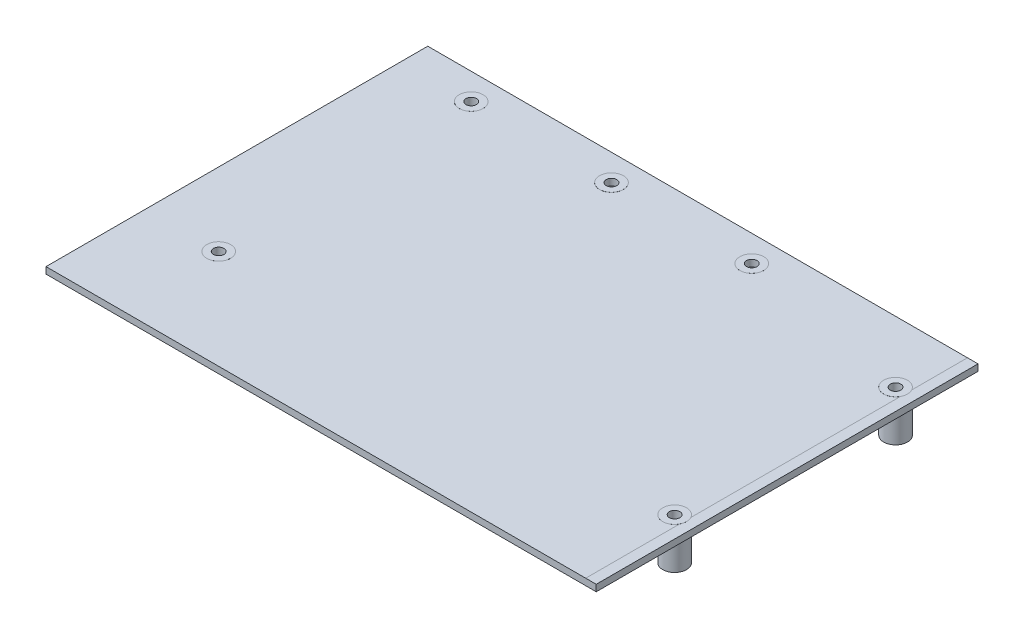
ISO-10303-21;
HEADER;
FILE_DESCRIPTION(('STEP AP214'),'2;1');
FILE_NAME('part.step','',(''),(''),'','','');
FILE_SCHEMA(('AUTOMOTIVE_DESIGN { 1 0 10303 214 1 1 1 1 }'));
ENDSEC;
DATA;
#1=APPLICATION_CONTEXT('core data for automotive mechanical design processes');
#2=APPLICATION_PROTOCOL_DEFINITION('international standard','automotive_design',2000,#1);
#3=PRODUCT_CONTEXT('',#1,'mechanical');
#4=PRODUCT('Part','Part','',(#3));
#5=PRODUCT_RELATED_PRODUCT_CATEGORY('part','',(#4));
#6=PRODUCT_DEFINITION_FORMATION('','',#4);
#7=PRODUCT_DEFINITION_CONTEXT('part definition',#1,'design');
#8=PRODUCT_DEFINITION('design','',#6,#7);
#9=PRODUCT_DEFINITION_SHAPE('','',#8);
#10=(LENGTH_UNIT() NAMED_UNIT(*) SI_UNIT(.MILLI.,.METRE.));
#11=(NAMED_UNIT(*) PLANE_ANGLE_UNIT() SI_UNIT($,.RADIAN.));
#12=(NAMED_UNIT(*) SI_UNIT($,.STERADIAN.) SOLID_ANGLE_UNIT());
#13=UNCERTAINTY_MEASURE_WITH_UNIT(LENGTH_MEASURE(1.E-05),#10,'distance_accuracy_value','');
#14=(GEOMETRIC_REPRESENTATION_CONTEXT(3) GLOBAL_UNCERTAINTY_ASSIGNED_CONTEXT((#13)) GLOBAL_UNIT_ASSIGNED_CONTEXT((#10,
#11,#12)) REPRESENTATION_CONTEXT('',''));
#15=CARTESIAN_POINT('',(0.,0.,0.));
#16=DIRECTION('',(0.,0.,1.));
#17=DIRECTION('',(1.,0.,0.));
#18=AXIS2_PLACEMENT_3D('',#15,#16,#17);
#19=CARTESIAN_POINT('',(-172.72,2.3622,0.));
#20=DIRECTION('',(0.,-1.,0.));
#21=DIRECTION('',(0.,0.,-1.));
#22=AXIS2_PLACEMENT_3D('',#19,#20,#21);
#23=PLANE('',#22);
#24=CARTESIAN_POINT('',(100.33,2.3622,9.525));
#25=DIRECTION('',(0.,-1.,0.));
#26=DIRECTION('',(0.,0.,-1.));
#27=AXIS2_PLACEMENT_3D('',#24,#25,#26);
#28=CIRCLE('',#27,4.318);
#29=CARTESIAN_POINT('',(100.33,2.3622,5.207));
#30=VERTEX_POINT('',#29);
#31=EDGE_CURVE('E42',#30,#30,#28,.F.);
#32=ORIENTED_EDGE('',*,*,#31,.F.);
#33=EDGE_LOOP('',(#32));
#34=FACE_BOUND('',#33,.T.);
#35=CARTESIAN_POINT('',(-1.27,2.3622,9.525));
#36=DIRECTION('',(0.,-1.,0.));
#37=DIRECTION('',(0.,0.,-1.));
#38=AXIS2_PLACEMENT_3D('',#35,#36,#37);
#39=CIRCLE('',#38,4.318);
#40=CARTESIAN_POINT('',(-1.27,2.3622,5.207));
#41=VERTEX_POINT('',#40);
#42=EDGE_CURVE('E209',#41,#41,#39,.F.);
#43=ORIENTED_EDGE('',*,*,#42,.F.);
#44=EDGE_LOOP('',(#43));
#45=FACE_BOUND('',#44,.T.);
#46=CARTESIAN_POINT('',(0.,2.3622,102.235));
#47=DIRECTION('',(0.,-1.,0.));
#48=DIRECTION('',(0.,0.,-1.));
#49=AXIS2_PLACEMENT_3D('',#46,#47,#48);
#50=CIRCLE('',#49,4.318);
#51=CARTESIAN_POINT('',(0.,2.3622,97.917));
#52=VERTEX_POINT('',#51);
#53=EDGE_CURVE('E303',#52,#52,#50,.F.);
#54=ORIENTED_EDGE('',*,*,#53,.F.);
#55=EDGE_LOOP('',(#54));
#56=FACE_BOUND('',#55,.T.);
#57=CARTESIAN_POINT('',(49.53,2.3622,9.525));
#58=DIRECTION('',(0.,-1.,0.));
#59=DIRECTION('',(0.,0.,-1.));
#60=AXIS2_PLACEMENT_3D('',#57,#58,#59);
#61=CIRCLE('',#60,4.318);
#62=CARTESIAN_POINT('',(49.53,2.3622,5.207));
#63=VERTEX_POINT('',#62);
#64=EDGE_CURVE('E199',#63,#63,#61,.F.);
#65=ORIENTED_EDGE('',*,*,#64,.F.);
#66=EDGE_LOOP('',(#65));
#67=FACE_BOUND('',#66,.T.);
#68=DIRECTION('',(-1.,0.,0.));
#69=VECTOR('',#68,1.);
#70=CARTESIAN_POINT('',(-172.72,2.3622,138.241508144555));
#71=LINE('',#70,#69);
#72=CARTESIAN_POINT('',(168.91,2.3622,138.241508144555));
#73=VERTEX_POINT('',#72);
#74=CARTESIAN_POINT('',(-26.5169260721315,2.3622,138.241508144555));
#75=VERTEX_POINT('',#74);
#76=EDGE_CURVE('E160',#73,#75,#71,.T.);
#77=ORIENTED_EDGE('',*,*,#76,.F.);
#78=DIRECTION('',(0.,0.,1.));
#79=VECTOR('',#78,1.);
#80=CARTESIAN_POINT('',(168.91,2.3622,0.));
#81=LINE('',#80,#79);
#82=CARTESIAN_POINT('',(168.91,2.3622,104.267));
#83=VERTEX_POINT('',#82);
#84=EDGE_CURVE('E255',#83,#73,#81,.T.);
#85=ORIENTED_EDGE('',*,*,#84,.F.);
#86=CARTESIAN_POINT('',(165.1,2.3622,102.235));
#87=DIRECTION('',(0.,-1.,0.));
#88=DIRECTION('',(0.,0.,-1.));
#89=AXIS2_PLACEMENT_3D('',#86,#87,#88);
#90=CIRCLE('',#89,4.318);
#91=CARTESIAN_POINT('',(168.91,2.3622,100.203));
#92=VERTEX_POINT('',#91);
#93=EDGE_CURVE('E216',#92,#83,#90,.F.);
#94=ORIENTED_EDGE('',*,*,#93,.F.);
#95=CARTESIAN_POINT('',(168.91,2.3622,24.257));
#96=VERTEX_POINT('',#95);
#97=EDGE_CURVE('E254',#96,#92,#81,.T.);
#98=ORIENTED_EDGE('',*,*,#97,.F.);
#99=CARTESIAN_POINT('',(165.1,2.3622,22.225));
#100=DIRECTION('',(0.,-1.,0.));
#101=DIRECTION('',(0.,0.,-1.));
#102=AXIS2_PLACEMENT_3D('',#99,#100,#101);
#103=CIRCLE('',#102,4.318);
#104=CARTESIAN_POINT('',(168.91,2.3622,20.193));
#105=VERTEX_POINT('',#104);
#106=EDGE_CURVE('E306',#105,#96,#103,.F.);
#107=ORIENTED_EDGE('',*,*,#106,.F.);
#108=CARTESIAN_POINT('',(168.91,2.3622,0.));
#109=VERTEX_POINT('',#108);
#110=EDGE_CURVE('E251',#109,#105,#81,.T.);
#111=ORIENTED_EDGE('',*,*,#110,.F.);
#112=DIRECTION('',(-1.,0.,0.));
#113=VECTOR('',#112,1.);
#114=CARTESIAN_POINT('',(-172.72,2.3622,0.));
#115=LINE('',#114,#113);
#116=CARTESIAN_POINT('',(-26.5169260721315,2.3622,0.));
#117=VERTEX_POINT('',#116);
#118=EDGE_CURVE('E309',#109,#117,#115,.T.);
#119=ORIENTED_EDGE('',*,*,#118,.T.);
#120=DIRECTION('',(0.,0.,-1.));
#121=VECTOR('',#120,1.);
#122=CARTESIAN_POINT('',(-26.5169260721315,2.3622,0.));
#123=LINE('',#122,#121);
#124=EDGE_CURVE('E154',#75,#117,#123,.T.);
#125=ORIENTED_EDGE('',*,*,#124,.F.);
#126=EDGE_LOOP('',(#77,#85,#94,#98,#107,#111,#119,#125));
#127=FACE_BOUND('',#126,.T.);
#128=ADVANCED_FACE('F34',(#34,#45,#56,#67,#127),#23,.F.);
#129=CARTESIAN_POINT('',(-172.72,0.,0.));
#130=DIRECTION('',(0.,-1.,0.));
#131=DIRECTION('',(0.,0.,-1.));
#132=AXIS2_PLACEMENT_3D('',#129,#130,#131);
#133=PLANE('',#132);
#134=CARTESIAN_POINT('',(100.33,0.,9.525));
#135=DIRECTION('',(0.,-1.,0.));
#136=DIRECTION('',(0.,0.,-1.));
#137=AXIS2_PLACEMENT_3D('',#134,#135,#136);
#138=CIRCLE('',#137,4.318);
#139=CARTESIAN_POINT('',(100.33,0.,5.207));
#140=VERTEX_POINT('',#139);
#141=EDGE_CURVE('E196',#140,#140,#138,.F.);
#142=ORIENTED_EDGE('',*,*,#141,.T.);
#143=EDGE_LOOP('',(#142));
#144=FACE_BOUND('',#143,.T.);
#145=CARTESIAN_POINT('',(-1.27,0.,9.525));
#146=DIRECTION('',(0.,-1.,0.));
#147=DIRECTION('',(0.,0.,-1.));
#148=AXIS2_PLACEMENT_3D('',#145,#146,#147);
#149=CIRCLE('',#148,4.318);
#150=CARTESIAN_POINT('',(-1.27,0.,5.207));
#151=VERTEX_POINT('',#150);
#152=EDGE_CURVE('E213',#151,#151,#149,.F.);
#153=ORIENTED_EDGE('',*,*,#152,.T.);
#154=EDGE_LOOP('',(#153));
#155=FACE_BOUND('',#154,.T.);
#156=CARTESIAN_POINT('',(0.,0.,102.235));
#157=DIRECTION('',(0.,-1.,0.));
#158=DIRECTION('',(0.,0.,-1.));
#159=AXIS2_PLACEMENT_3D('',#156,#157,#158);
#160=CIRCLE('',#159,4.318);
#161=CARTESIAN_POINT('',(0.,0.,97.917));
#162=VERTEX_POINT('',#161);
#163=EDGE_CURVE('E302',#162,#162,#160,.F.);
#164=ORIENTED_EDGE('',*,*,#163,.T.);
#165=EDGE_LOOP('',(#164));
#166=FACE_BOUND('',#165,.T.);
#167=CARTESIAN_POINT('',(49.53,0.,9.525));
#168=DIRECTION('',(0.,-1.,0.));
#169=DIRECTION('',(0.,0.,-1.));
#170=AXIS2_PLACEMENT_3D('',#167,#168,#169);
#171=CIRCLE('',#170,4.318);
#172=CARTESIAN_POINT('',(49.53,0.,5.207));
#173=VERTEX_POINT('',#172);
#174=EDGE_CURVE('E206',#173,#173,#171,.F.);
#175=ORIENTED_EDGE('',*,*,#174,.T.);
#176=EDGE_LOOP('',(#175));
#177=FACE_BOUND('',#176,.T.);
#178=DIRECTION('',(0.,0.,1.));
#179=VECTOR('',#178,1.);
#180=CARTESIAN_POINT('',(168.91,0.,0.));
#181=LINE('',#180,#179);
#182=CARTESIAN_POINT('',(168.91,0.,104.267));
#183=VERTEX_POINT('',#182);
#184=CARTESIAN_POINT('',(168.91,0.,138.241508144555));
#185=VERTEX_POINT('',#184);
#186=EDGE_CURVE('E167',#183,#185,#181,.T.);
#187=ORIENTED_EDGE('',*,*,#186,.T.);
#188=DIRECTION('',(-1.,0.,0.));
#189=VECTOR('',#188,1.);
#190=CARTESIAN_POINT('',(-172.72,0.,138.241508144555));
#191=LINE('',#190,#189);
#192=CARTESIAN_POINT('',(-26.5169260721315,0.,138.241508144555));
#193=VERTEX_POINT('',#192);
#194=EDGE_CURVE('E155',#185,#193,#191,.T.);
#195=ORIENTED_EDGE('',*,*,#194,.T.);
#196=DIRECTION('',(0.,0.,-1.));
#197=VECTOR('',#196,1.);
#198=CARTESIAN_POINT('',(-26.5169260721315,0.,0.));
#199=LINE('',#198,#197);
#200=CARTESIAN_POINT('',(-26.5169260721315,0.,0.));
#201=VERTEX_POINT('',#200);
#202=EDGE_CURVE('E146',#193,#201,#199,.T.);
#203=ORIENTED_EDGE('',*,*,#202,.T.);
#204=DIRECTION('',(-1.,0.,0.));
#205=VECTOR('',#204,1.);
#206=CARTESIAN_POINT('',(-172.72,0.,0.));
#207=LINE('',#206,#205);
#208=CARTESIAN_POINT('',(168.91,0.,0.));
#209=VERTEX_POINT('',#208);
#210=EDGE_CURVE('E56',#209,#201,#207,.T.);
#211=ORIENTED_EDGE('',*,*,#210,.F.);
#212=CARTESIAN_POINT('',(168.91,0.,20.193));
#213=VERTEX_POINT('',#212);
#214=EDGE_CURVE('E246',#209,#213,#181,.T.);
#215=ORIENTED_EDGE('',*,*,#214,.T.);
#216=CARTESIAN_POINT('',(165.1,0.,22.225));
#217=DIRECTION('',(0.,-1.,0.));
#218=DIRECTION('',(0.,0.,-1.));
#219=AXIS2_PLACEMENT_3D('',#216,#217,#218);
#220=CIRCLE('',#219,4.318);
#221=CARTESIAN_POINT('',(168.91,0.,24.257));
#222=VERTEX_POINT('',#221);
#223=EDGE_CURVE('E296',#213,#222,#220,.F.);
#224=ORIENTED_EDGE('',*,*,#223,.T.);
#225=CARTESIAN_POINT('',(168.91,0.,100.203));
#226=VERTEX_POINT('',#225);
#227=EDGE_CURVE('E250',#222,#226,#181,.T.);
#228=ORIENTED_EDGE('',*,*,#227,.T.);
#229=CARTESIAN_POINT('',(165.1,0.,102.235));
#230=DIRECTION('',(0.,-1.,0.));
#231=DIRECTION('',(0.,0.,-1.));
#232=AXIS2_PLACEMENT_3D('',#229,#230,#231);
#233=CIRCLE('',#232,4.318);
#234=EDGE_CURVE('E291',#226,#183,#233,.F.);
#235=ORIENTED_EDGE('',*,*,#234,.T.);
#236=EDGE_LOOP('',(#187,#195,#203,#211,#215,#224,#228,#235));
#237=FACE_BOUND('',#236,.T.);
#238=ADVANCED_FACE('F164',(#144,#155,#166,#177,#237),#133,.T.);
#239=CARTESIAN_POINT('',(172.72,2.3622,269.24));
#240=DIRECTION('',(-1.,0.,0.));
#241=DIRECTION('',(0.,0.,1.));
#242=AXIS2_PLACEMENT_3D('',#239,#240,#241);
#243=PLANE('',#242);
#244=DIRECTION('',(0.,1.,0.));
#245=VECTOR('',#244,1.);
#246=CARTESIAN_POINT('',(172.72,-0.0127,138.241508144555));
#247=LINE('',#246,#245);
#248=CARTESIAN_POINT('',(172.72,-0.00126999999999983,138.241508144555));
#249=VERTEX_POINT('',#248);
#250=CARTESIAN_POINT('',(172.72,2.36347,138.241508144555));
#251=VERTEX_POINT('',#250);
#252=EDGE_CURVE('E161',#249,#251,#247,.T.);
#253=ORIENTED_EDGE('',*,*,#252,.F.);
#254=DIRECTION('',(0.,0.,-1.));
#255=VECTOR('',#254,1.);
#256=CARTESIAN_POINT('',(172.72,-0.00126999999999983,0.));
#257=LINE('',#256,#255);
#258=CARTESIAN_POINT('',(172.72,-0.00126999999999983,0.));
#259=VERTEX_POINT('',#258);
#260=EDGE_CURVE('E224',#249,#259,#257,.T.);
#261=ORIENTED_EDGE('',*,*,#260,.T.);
#262=DIRECTION('',(0.,-1.,0.));
#263=VECTOR('',#262,1.);
#264=CARTESIAN_POINT('',(172.72,2.3622,0.));
#265=LINE('',#264,#263);
#266=CARTESIAN_POINT('',(172.72,2.36347,0.));
#267=VERTEX_POINT('',#266);
#268=EDGE_CURVE('E307',#267,#259,#265,.T.);
#269=ORIENTED_EDGE('',*,*,#268,.F.);
#270=DIRECTION('',(0.,0.,-1.));
#271=VECTOR('',#270,1.);
#272=CARTESIAN_POINT('',(172.72,2.36347,0.));
#273=LINE('',#272,#271);
#274=EDGE_CURVE('E234',#251,#267,#273,.T.);
#275=ORIENTED_EDGE('',*,*,#274,.F.);
#276=EDGE_LOOP('',(#253,#261,#269,#275));
#277=FACE_BOUND('',#276,.T.);
#278=ADVANCED_FACE('F36',(#277),#243,.F.);
#279=CARTESIAN_POINT('',(-172.72,2.3622,0.));
#280=DIRECTION('',(0.,0.,1.));
#281=DIRECTION('',(1.,0.,0.));
#282=AXIS2_PLACEMENT_3D('',#279,#280,#281);
#283=PLANE('',#282);
#284=DIRECTION('',(0.,1.,0.));
#285=VECTOR('',#284,1.);
#286=CARTESIAN_POINT('',(-26.5169260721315,-0.0127,0.));
#287=LINE('',#286,#285);
#288=EDGE_CURVE('E152',#201,#117,#287,.T.);
#289=ORIENTED_EDGE('',*,*,#288,.T.);
#290=ORIENTED_EDGE('',*,*,#118,.F.);
#291=DIRECTION('',(0.,-1.,0.));
#292=VECTOR('',#291,1.);
#293=CARTESIAN_POINT('',(168.91,2.36347,0.));
#294=LINE('',#293,#292);
#295=CARTESIAN_POINT('',(168.91,2.36347,0.));
#296=VERTEX_POINT('',#295);
#297=EDGE_CURVE('E238',#296,#109,#294,.T.);
#298=ORIENTED_EDGE('',*,*,#297,.F.);
#299=DIRECTION('',(-1.,0.,0.));
#300=VECTOR('',#299,1.);
#301=CARTESIAN_POINT('',(172.72,2.36347,0.));
#302=LINE('',#301,#300);
#303=EDGE_CURVE('E227',#267,#296,#302,.T.);
#304=ORIENTED_EDGE('',*,*,#303,.F.);
#305=ORIENTED_EDGE('',*,*,#268,.T.);
#306=DIRECTION('',(-1.,0.,0.));
#307=VECTOR('',#306,1.);
#308=CARTESIAN_POINT('',(172.72,-0.00126999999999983,0.));
#309=LINE('',#308,#307);
#310=CARTESIAN_POINT('',(168.91,-0.00126999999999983,0.));
#311=VERTEX_POINT('',#310);
#312=EDGE_CURVE('E217',#259,#311,#309,.T.);
#313=ORIENTED_EDGE('',*,*,#312,.T.);
#314=EDGE_CURVE('E237',#209,#311,#294,.T.);
#315=ORIENTED_EDGE('',*,*,#314,.F.);
#316=ORIENTED_EDGE('',*,*,#210,.T.);
#317=EDGE_LOOP('',(#289,#290,#298,#304,#305,#313,#315,#316));
#318=FACE_BOUND('',#317,.T.);
#319=ADVANCED_FACE('F359',(#318),#283,.F.);
#320=CARTESIAN_POINT('',(168.91,-0.00126999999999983,0.));
#321=DIRECTION('',(0.,1.,0.));
#322=DIRECTION('',(0.,0.,1.));
#323=AXIS2_PLACEMENT_3D('',#320,#321,#322);
#324=PLANE('',#323);
#325=DIRECTION('',(1.,0.,0.));
#326=VECTOR('',#325,1.);
#327=CARTESIAN_POINT('',(168.91,-0.00126999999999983,138.241508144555));
#328=LINE('',#327,#326);
#329=CARTESIAN_POINT('',(168.91,-0.00126999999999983,138.241508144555));
#330=VERTEX_POINT('',#329);
#331=EDGE_CURVE('E168',#330,#249,#328,.T.);
#332=ORIENTED_EDGE('',*,*,#331,.F.);
#333=DIRECTION('',(0.,0.,1.));
#334=VECTOR('',#333,1.);
#335=CARTESIAN_POINT('',(168.91,-0.00126999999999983,0.));
#336=LINE('',#335,#334);
#337=CARTESIAN_POINT('',(168.91,-0.00126999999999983,104.267));
#338=VERTEX_POINT('',#337);
#339=EDGE_CURVE('E220',#338,#330,#336,.T.);
#340=ORIENTED_EDGE('',*,*,#339,.F.);
#341=CARTESIAN_POINT('',(165.1,-0.00126999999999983,102.235));
#342=DIRECTION('',(0.,1.,0.));
#343=DIRECTION('',(0.,0.,1.));
#344=AXIS2_PLACEMENT_3D('',#341,#342,#343);
#345=CIRCLE('',#344,4.318);
#346=CARTESIAN_POINT('',(168.91,-0.00126999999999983,100.203));
#347=VERTEX_POINT('',#346);
#348=EDGE_CURVE('E240',#338,#347,#345,.T.);
#349=ORIENTED_EDGE('',*,*,#348,.T.);
#350=CARTESIAN_POINT('',(168.91,-0.00126999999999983,24.257));
#351=VERTEX_POINT('',#350);
#352=EDGE_CURVE('E225',#351,#347,#336,.T.);
#353=ORIENTED_EDGE('',*,*,#352,.F.);
#354=CARTESIAN_POINT('',(165.1,-0.00126999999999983,22.225));
#355=DIRECTION('',(0.,1.,0.));
#356=DIRECTION('',(0.,0.,1.));
#357=AXIS2_PLACEMENT_3D('',#354,#355,#356);
#358=CIRCLE('',#357,4.318);
#359=CARTESIAN_POINT('',(168.91,-0.00126999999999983,20.193));
#360=VERTEX_POINT('',#359);
#361=EDGE_CURVE('E243',#351,#360,#358,.T.);
#362=ORIENTED_EDGE('',*,*,#361,.T.);
#363=EDGE_CURVE('E221',#311,#360,#336,.T.);
#364=ORIENTED_EDGE('',*,*,#363,.F.);
#365=ORIENTED_EDGE('',*,*,#312,.F.);
#366=ORIENTED_EDGE('',*,*,#260,.F.);
#367=EDGE_LOOP('',(#332,#340,#349,#353,#362,#364,#365,#366));
#368=FACE_BOUND('',#367,.T.);
#369=ADVANCED_FACE('F361',(#368),#324,.F.);
#370=CARTESIAN_POINT('',(168.91,2.36347,0.));
#371=DIRECTION('',(1.,0.,0.));
#372=DIRECTION('',(0.,0.,-1.));
#373=AXIS2_PLACEMENT_3D('',#370,#371,#372);
#374=PLANE('',#373);
#375=DIRECTION('',(0.,-1.,0.));
#376=VECTOR('',#375,1.);
#377=CARTESIAN_POINT('',(168.91,2.36347,138.241508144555));
#378=LINE('',#377,#376);
#379=EDGE_CURVE('E170',#185,#330,#378,.T.);
#380=ORIENTED_EDGE('',*,*,#379,.F.);
#381=ORIENTED_EDGE('',*,*,#186,.F.);
#382=DIRECTION('',(0.,-1.,0.));
#383=VECTOR('',#382,1.);
#384=CARTESIAN_POINT('',(168.91,2.3749,104.267));
#385=LINE('',#384,#383);
#386=EDGE_CURVE('E256',#183,#338,#385,.T.);
#387=ORIENTED_EDGE('',*,*,#386,.T.);
#388=ORIENTED_EDGE('',*,*,#339,.T.);
#389=EDGE_LOOP('',(#380,#381,#387,#388));
#390=FACE_BOUND('',#389,.T.);
#391=ADVANCED_FACE('F367',(#390),#374,.F.);
#392=CARTESIAN_POINT('',(168.91,2.36347,0.));
#393=DIRECTION('',(0.,1.,0.));
#394=DIRECTION('',(0.,0.,1.));
#395=AXIS2_PLACEMENT_3D('',#392,#393,#394);
#396=PLANE('',#395);
#397=DIRECTION('',(0.,0.,1.));
#398=VECTOR('',#397,1.);
#399=CARTESIAN_POINT('',(168.91,2.36347,0.));
#400=LINE('',#399,#398);
#401=CARTESIAN_POINT('',(168.91,2.36347,104.267));
#402=VERTEX_POINT('',#401);
#403=CARTESIAN_POINT('',(168.91,2.36347,138.241508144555));
#404=VERTEX_POINT('',#403);
#405=EDGE_CURVE('E230',#402,#404,#400,.T.);
#406=ORIENTED_EDGE('',*,*,#405,.T.);
#407=DIRECTION('',(1.,0.,0.));
#408=VECTOR('',#407,1.);
#409=CARTESIAN_POINT('',(168.91,2.36347,138.241508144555));
#410=LINE('',#409,#408);
#411=EDGE_CURVE('E48',#404,#251,#410,.T.);
#412=ORIENTED_EDGE('',*,*,#411,.T.);
#413=ORIENTED_EDGE('',*,*,#274,.T.);
#414=ORIENTED_EDGE('',*,*,#303,.T.);
#415=CARTESIAN_POINT('',(168.91,2.36347,20.193));
#416=VERTEX_POINT('',#415);
#417=EDGE_CURVE('E231',#296,#416,#400,.T.);
#418=ORIENTED_EDGE('',*,*,#417,.T.);
#419=CARTESIAN_POINT('',(165.1,2.36347,22.225));
#420=DIRECTION('',(0.,1.,0.));
#421=DIRECTION('',(0.,0.,1.));
#422=AXIS2_PLACEMENT_3D('',#419,#420,#421);
#423=CIRCLE('',#422,4.318);
#424=CARTESIAN_POINT('',(168.91,2.36347,24.257));
#425=VERTEX_POINT('',#424);
#426=EDGE_CURVE('E276',#425,#416,#423,.T.);
#427=ORIENTED_EDGE('',*,*,#426,.F.);
#428=CARTESIAN_POINT('',(168.91,2.36347,100.203));
#429=VERTEX_POINT('',#428);
#430=EDGE_CURVE('E235',#425,#429,#400,.T.);
#431=ORIENTED_EDGE('',*,*,#430,.T.);
#432=CARTESIAN_POINT('',(165.1,2.36347,102.235));
#433=DIRECTION('',(0.,1.,0.));
#434=DIRECTION('',(0.,0.,1.));
#435=AXIS2_PLACEMENT_3D('',#432,#433,#434);
#436=CIRCLE('',#435,4.318);
#437=EDGE_CURVE('E253',#402,#429,#436,.T.);
#438=ORIENTED_EDGE('',*,*,#437,.F.);
#439=EDGE_LOOP('',(#406,#412,#413,#414,#418,#427,#431,#438));
#440=FACE_BOUND('',#439,.T.);
#441=ADVANCED_FACE('F390',(#440),#396,.T.);
#442=DIRECTION('',(0.,-1.,0.));
#443=VECTOR('',#442,1.);
#444=CARTESIAN_POINT('',(168.91,2.36347,138.241508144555));
#445=LINE('',#444,#443);
#446=EDGE_CURVE('E12',#404,#73,#445,.T.);
#447=ORIENTED_EDGE('',*,*,#446,.F.);
#448=ORIENTED_EDGE('',*,*,#405,.F.);
#449=DIRECTION('',(0.,-1.,0.));
#450=VECTOR('',#449,1.);
#451=CARTESIAN_POINT('',(168.91,2.3749,104.267));
#452=LINE('',#451,#450);
#453=EDGE_CURVE('E259',#402,#83,#452,.T.);
#454=ORIENTED_EDGE('',*,*,#453,.T.);
#455=ORIENTED_EDGE('',*,*,#84,.T.);
#456=EDGE_LOOP('',(#447,#448,#454,#455));
#457=FACE_BOUND('',#456,.T.);
#458=ADVANCED_FACE('F398',(#457),#374,.F.);
#459=CARTESIAN_POINT('',(165.1,2.3749,22.225));
#460=DIRECTION('',(0.,-1.,0.));
#461=DIRECTION('',(0.,0.,-1.));
#462=AXIS2_PLACEMENT_3D('',#459,#460,#461);
#463=CYLINDRICAL_SURFACE('',#462,4.318);
#464=CARTESIAN_POINT('',(165.1,2.3749,22.225));
#465=DIRECTION('',(0.,1.,0.));
#466=DIRECTION('',(0.,0.,1.));
#467=AXIS2_PLACEMENT_3D('',#464,#465,#466);
#468=CIRCLE('',#467,4.318);
#469=CARTESIAN_POINT('',(165.1,2.3749,26.543));
#470=VERTEX_POINT('',#469);
#471=EDGE_CURVE('E293',#470,#470,#468,.T.);
#472=ORIENTED_EDGE('',*,*,#471,.F.);
#473=EDGE_LOOP('',(#472));
#474=FACE_BOUND('',#473,.T.);
#475=DIRECTION('',(0.,-1.,0.));
#476=VECTOR('',#475,1.);
#477=CARTESIAN_POINT('',(168.91,2.3749,24.257));
#478=LINE('',#477,#476);
#479=EDGE_CURVE('E269',#425,#96,#478,.T.);
#480=ORIENTED_EDGE('',*,*,#479,.F.);
#481=ORIENTED_EDGE('',*,*,#426,.T.);
#482=DIRECTION('',(0.,-1.,0.));
#483=VECTOR('',#482,1.);
#484=CARTESIAN_POINT('',(168.91,2.3749,20.193));
#485=LINE('',#484,#483);
#486=EDGE_CURVE('E248',#105,#416,#485,.F.);
#487=ORIENTED_EDGE('',*,*,#486,.F.);
#488=ORIENTED_EDGE('',*,*,#106,.T.);
#489=EDGE_LOOP('',(#480,#481,#487,#488));
#490=FACE_BOUND('',#489,.T.);
#491=ADVANCED_FACE('F385',(#474,#490),#463,.T.);
#492=DIRECTION('',(0.,-1.,0.));
#493=VECTOR('',#492,1.);
#494=CARTESIAN_POINT('',(168.91,2.3749,24.257));
#495=LINE('',#494,#493);
#496=EDGE_CURVE('E264',#222,#351,#495,.T.);
#497=ORIENTED_EDGE('',*,*,#496,.F.);
#498=ORIENTED_EDGE('',*,*,#223,.F.);
#499=DIRECTION('',(0.,-1.,0.));
#500=VECTOR('',#499,1.);
#501=CARTESIAN_POINT('',(168.91,2.3749,20.193));
#502=LINE('',#501,#500);
#503=EDGE_CURVE('E249',#360,#213,#502,.F.);
#504=ORIENTED_EDGE('',*,*,#503,.F.);
#505=ORIENTED_EDGE('',*,*,#361,.F.);
#506=EDGE_LOOP('',(#497,#498,#504,#505));
#507=FACE_BOUND('',#506,.T.);
#508=CARTESIAN_POINT('',(165.1,-12.7127,22.225));
#509=DIRECTION('',(0.,-1.,0.));
#510=DIRECTION('',(0.,0.,-1.));
#511=AXIS2_PLACEMENT_3D('',#508,#509,#510);
#512=CIRCLE('',#511,4.31799999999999);
#513=CARTESIAN_POINT('',(165.1,-12.7127,17.907));
#514=VERTEX_POINT('',#513);
#515=EDGE_CURVE('E374',#514,#514,#512,.T.);
#516=ORIENTED_EDGE('',*,*,#515,.F.);
#517=EDGE_LOOP('',(#516));
#518=FACE_BOUND('',#517,.T.);
#519=ADVANCED_FACE('F529',(#507,#518),#463,.T.);
#520=CARTESIAN_POINT('',(165.1,2.3749,102.235));
#521=DIRECTION('',(0.,-1.,0.));
#522=DIRECTION('',(0.,0.,-1.));
#523=AXIS2_PLACEMENT_3D('',#520,#521,#522);
#524=CYLINDRICAL_SURFACE('',#523,4.318);
#525=CARTESIAN_POINT('',(165.1,2.3749,102.235));
#526=DIRECTION('',(0.,1.,0.));
#527=DIRECTION('',(0.,0.,1.));
#528=AXIS2_PLACEMENT_3D('',#525,#526,#527);
#529=CIRCLE('',#528,4.318);
#530=CARTESIAN_POINT('',(165.1,2.3749,106.553));
#531=VERTEX_POINT('',#530);
#532=EDGE_CURVE('E288',#531,#531,#529,.T.);
#533=ORIENTED_EDGE('',*,*,#532,.F.);
#534=EDGE_LOOP('',(#533));
#535=FACE_BOUND('',#534,.T.);
#536=ORIENTED_EDGE('',*,*,#453,.F.);
#537=ORIENTED_EDGE('',*,*,#437,.T.);
#538=DIRECTION('',(0.,-1.,0.));
#539=VECTOR('',#538,1.);
#540=CARTESIAN_POINT('',(168.91,2.3749,100.203));
#541=LINE('',#540,#539);
#542=EDGE_CURVE('E267',#92,#429,#541,.F.);
#543=ORIENTED_EDGE('',*,*,#542,.F.);
#544=ORIENTED_EDGE('',*,*,#93,.T.);
#545=EDGE_LOOP('',(#536,#537,#543,#544));
#546=FACE_BOUND('',#545,.T.);
#547=ADVANCED_FACE('F402',(#535,#546),#524,.T.);
#548=ORIENTED_EDGE('',*,*,#386,.F.);
#549=ORIENTED_EDGE('',*,*,#234,.F.);
#550=DIRECTION('',(0.,-1.,0.));
#551=VECTOR('',#550,1.);
#552=CARTESIAN_POINT('',(168.91,2.3749,100.203));
#553=LINE('',#552,#551);
#554=EDGE_CURVE('E261',#347,#226,#553,.F.);
#555=ORIENTED_EDGE('',*,*,#554,.F.);
#556=ORIENTED_EDGE('',*,*,#348,.F.);
#557=EDGE_LOOP('',(#548,#549,#555,#556));
#558=FACE_BOUND('',#557,.T.);
#559=CARTESIAN_POINT('',(165.1,-12.7127,102.235));
#560=DIRECTION('',(0.,-1.,0.));
#561=DIRECTION('',(0.,0.,-1.));
#562=AXIS2_PLACEMENT_3D('',#559,#560,#561);
#563=CIRCLE('',#562,4.31800000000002);
#564=CARTESIAN_POINT('',(165.1,-12.7127,97.917));
#565=VERTEX_POINT('',#564);
#566=EDGE_CURVE('E413',#565,#565,#563,.T.);
#567=ORIENTED_EDGE('',*,*,#566,.F.);
#568=EDGE_LOOP('',(#567));
#569=FACE_BOUND('',#568,.T.);
#570=ADVANCED_FACE('F528',(#558,#569),#524,.T.);
#571=CARTESIAN_POINT('',(0.,2.3749,102.235));
#572=DIRECTION('',(0.,-1.,0.));
#573=DIRECTION('',(0.,0.,-1.));
#574=AXIS2_PLACEMENT_3D('',#571,#572,#573);
#575=CYLINDRICAL_SURFACE('',#574,4.318);
#576=ORIENTED_EDGE('',*,*,#163,.F.);
#577=EDGE_LOOP('',(#576));
#578=FACE_BOUND('',#577,.T.);
#579=CARTESIAN_POINT('',(0.,-12.7127,102.235));
#580=DIRECTION('',(0.,-1.,0.));
#581=DIRECTION('',(0.,0.,-1.));
#582=AXIS2_PLACEMENT_3D('',#579,#580,#581);
#583=CIRCLE('',#582,4.318);
#584=CARTESIAN_POINT('',(0.,-12.7127,97.917));
#585=VERTEX_POINT('',#584);
#586=EDGE_CURVE('E419',#585,#585,#583,.T.);
#587=ORIENTED_EDGE('',*,*,#586,.F.);
#588=EDGE_LOOP('',(#587));
#589=FACE_BOUND('',#588,.T.);
#590=ADVANCED_FACE('F541',(#578,#589),#575,.T.);
#591=CARTESIAN_POINT('',(0.,2.3749,102.235));
#592=DIRECTION('',(0.,1.,0.));
#593=DIRECTION('',(0.,0.,1.));
#594=AXIS2_PLACEMENT_3D('',#591,#592,#593);
#595=CIRCLE('',#594,4.318);
#596=CARTESIAN_POINT('',(0.,2.3749,106.553));
#597=VERTEX_POINT('',#596);
#598=EDGE_CURVE('E299',#597,#597,#595,.T.);
#599=ORIENTED_EDGE('',*,*,#598,.F.);
#600=EDGE_LOOP('',(#599));
#601=FACE_BOUND('',#600,.T.);
#602=ORIENTED_EDGE('',*,*,#53,.T.);
#603=EDGE_LOOP('',(#602));
#604=FACE_BOUND('',#603,.T.);
#605=ADVANCED_FACE('F539',(#601,#604),#575,.T.);
#606=CARTESIAN_POINT('',(0.,2.3749,102.235));
#607=DIRECTION('',(0.,1.,0.));
#608=DIRECTION('',(0.,0.,1.));
#609=AXIS2_PLACEMENT_3D('',#606,#607,#608);
#610=PLANE('',#609);
#611=CARTESIAN_POINT('',(0.,2.3749,102.235));
#612=DIRECTION('',(0.,1.,0.));
#613=DIRECTION('',(0.,0.,1.));
#614=AXIS2_PLACEMENT_3D('',#611,#612,#613);
#615=CIRCLE('',#614,1.905);
#616=CARTESIAN_POINT('',(0.,2.3749,104.14));
#617=VERTEX_POINT('',#616);
#618=EDGE_CURVE('E285',#617,#617,#615,.T.);
#619=ORIENTED_EDGE('',*,*,#618,.F.);
#620=EDGE_LOOP('',(#619));
#621=FACE_BOUND('',#620,.T.);
#622=ORIENTED_EDGE('',*,*,#598,.T.);
#623=EDGE_LOOP('',(#622));
#624=FACE_BOUND('',#623,.T.);
#625=ADVANCED_FACE('F533',(#621,#624),#610,.T.);
#626=CARTESIAN_POINT('',(165.1,2.3749,22.225));
#627=DIRECTION('',(0.,1.,0.));
#628=DIRECTION('',(0.,0.,1.));
#629=AXIS2_PLACEMENT_3D('',#626,#627,#628);
#630=PLANE('',#629);
#631=CARTESIAN_POINT('',(165.1,2.3749,22.225));
#632=DIRECTION('',(0.,1.,0.));
#633=DIRECTION('',(0.,0.,1.));
#634=AXIS2_PLACEMENT_3D('',#631,#632,#633);
#635=CIRCLE('',#634,1.905);
#636=CARTESIAN_POINT('',(165.1,2.3749,24.13));
#637=VERTEX_POINT('',#636);
#638=EDGE_CURVE('E282',#637,#637,#635,.T.);
#639=ORIENTED_EDGE('',*,*,#638,.F.);
#640=EDGE_LOOP('',(#639));
#641=FACE_BOUND('',#640,.T.);
#642=ORIENTED_EDGE('',*,*,#471,.T.);
#643=EDGE_LOOP('',(#642));
#644=FACE_BOUND('',#643,.T.);
#645=ADVANCED_FACE('F524',(#641,#644),#630,.T.);
#646=CARTESIAN_POINT('',(165.1,2.3749,102.235));
#647=DIRECTION('',(0.,1.,0.));
#648=DIRECTION('',(0.,0.,1.));
#649=AXIS2_PLACEMENT_3D('',#646,#647,#648);
#650=PLANE('',#649);
#651=CARTESIAN_POINT('',(165.1,2.3749,102.235));
#652=DIRECTION('',(0.,1.,0.));
#653=DIRECTION('',(0.,0.,1.));
#654=AXIS2_PLACEMENT_3D('',#651,#652,#653);
#655=CIRCLE('',#654,1.905);
#656=CARTESIAN_POINT('',(165.1,2.3749,104.14));
#657=VERTEX_POINT('',#656);
#658=EDGE_CURVE('E279',#657,#657,#655,.T.);
#659=ORIENTED_EDGE('',*,*,#658,.F.);
#660=EDGE_LOOP('',(#659));
#661=FACE_BOUND('',#660,.T.);
#662=ORIENTED_EDGE('',*,*,#532,.T.);
#663=EDGE_LOOP('',(#662));
#664=FACE_BOUND('',#663,.T.);
#665=ADVANCED_FACE('F520',(#661,#664),#650,.T.);
#666=CARTESIAN_POINT('',(0.,-0.0127,102.235));
#667=DIRECTION('',(0.,1.,0.));
#668=DIRECTION('',(0.,0.,1.));
#669=AXIS2_PLACEMENT_3D('',#666,#667,#668);
#670=CYLINDRICAL_SURFACE('',#669,1.905);
#671=ORIENTED_EDGE('',*,*,#618,.T.);
#672=EDGE_LOOP('',(#671));
#673=FACE_BOUND('',#672,.T.);
#674=CARTESIAN_POINT('',(0.,-12.7127,102.235));
#675=DIRECTION('',(0.,-1.,0.));
#676=DIRECTION('',(0.,0.,-1.));
#677=AXIS2_PLACEMENT_3D('',#674,#675,#676);
#678=CIRCLE('',#677,1.90500000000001);
#679=CARTESIAN_POINT('',(0.,-12.7127,100.33));
#680=VERTEX_POINT('',#679);
#681=EDGE_CURVE('E422',#680,#680,#678,.T.);
#682=ORIENTED_EDGE('',*,*,#681,.T.);
#683=EDGE_LOOP('',(#682));
#684=FACE_BOUND('',#683,.T.);
#685=ADVANCED_FACE('F516',(#673,#684),#670,.F.);
#686=CARTESIAN_POINT('',(165.1,-0.0127,22.225));
#687=DIRECTION('',(0.,1.,0.));
#688=DIRECTION('',(0.,0.,1.));
#689=AXIS2_PLACEMENT_3D('',#686,#687,#688);
#690=CYLINDRICAL_SURFACE('',#689,1.905);
#691=ORIENTED_EDGE('',*,*,#638,.T.);
#692=EDGE_LOOP('',(#691));
#693=FACE_BOUND('',#692,.T.);
#694=CARTESIAN_POINT('',(165.1,-12.7127,22.225));
#695=DIRECTION('',(0.,-1.,0.));
#696=DIRECTION('',(0.,0.,-1.));
#697=AXIS2_PLACEMENT_3D('',#694,#695,#696);
#698=CIRCLE('',#697,1.90499999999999);
#699=CARTESIAN_POINT('',(165.1,-12.7127,20.32));
#700=VERTEX_POINT('',#699);
#701=EDGE_CURVE('E410',#700,#700,#698,.T.);
#702=ORIENTED_EDGE('',*,*,#701,.T.);
#703=EDGE_LOOP('',(#702));
#704=FACE_BOUND('',#703,.T.);
#705=ADVANCED_FACE('F512',(#693,#704),#690,.F.);
#706=CARTESIAN_POINT('',(165.1,-0.0127,102.235));
#707=DIRECTION('',(0.,1.,0.));
#708=DIRECTION('',(0.,0.,1.));
#709=AXIS2_PLACEMENT_3D('',#706,#707,#708);
#710=CYLINDRICAL_SURFACE('',#709,1.905);
#711=ORIENTED_EDGE('',*,*,#658,.T.);
#712=EDGE_LOOP('',(#711));
#713=FACE_BOUND('',#712,.T.);
#714=CARTESIAN_POINT('',(165.1,-12.7127,102.235));
#715=DIRECTION('',(0.,-1.,0.));
#716=DIRECTION('',(0.,0.,-1.));
#717=AXIS2_PLACEMENT_3D('',#714,#715,#716);
#718=CIRCLE('',#717,1.905);
#719=CARTESIAN_POINT('',(165.1,-12.7127,100.33));
#720=VERTEX_POINT('',#719);
#721=EDGE_CURVE('E416',#720,#720,#718,.T.);
#722=ORIENTED_EDGE('',*,*,#721,.T.);
#723=EDGE_LOOP('',(#722));
#724=FACE_BOUND('',#723,.T.);
#725=ADVANCED_FACE('F509',(#713,#724),#710,.F.);
#726=ORIENTED_EDGE('',*,*,#214,.F.);
#727=ORIENTED_EDGE('',*,*,#314,.T.);
#728=ORIENTED_EDGE('',*,*,#363,.T.);
#729=ORIENTED_EDGE('',*,*,#503,.T.);
#730=EDGE_LOOP('',(#726,#727,#728,#729));
#731=FACE_BOUND('',#730,.T.);
#732=ADVANCED_FACE('F508',(#731),#374,.F.);
#733=ORIENTED_EDGE('',*,*,#227,.F.);
#734=ORIENTED_EDGE('',*,*,#496,.T.);
#735=ORIENTED_EDGE('',*,*,#352,.T.);
#736=ORIENTED_EDGE('',*,*,#554,.T.);
#737=EDGE_LOOP('',(#733,#734,#735,#736));
#738=FACE_BOUND('',#737,.T.);
#739=ADVANCED_FACE('F811',(#738),#374,.F.);
#740=ORIENTED_EDGE('',*,*,#297,.T.);
#741=ORIENTED_EDGE('',*,*,#110,.T.);
#742=ORIENTED_EDGE('',*,*,#486,.T.);
#743=ORIENTED_EDGE('',*,*,#417,.F.);
#744=EDGE_LOOP('',(#740,#741,#742,#743));
#745=FACE_BOUND('',#744,.T.);
#746=ADVANCED_FACE('F382',(#745),#374,.F.);
#747=ORIENTED_EDGE('',*,*,#430,.F.);
#748=ORIENTED_EDGE('',*,*,#479,.T.);
#749=ORIENTED_EDGE('',*,*,#97,.T.);
#750=ORIENTED_EDGE('',*,*,#542,.T.);
#751=EDGE_LOOP('',(#747,#748,#749,#750));
#752=FACE_BOUND('',#751,.T.);
#753=ADVANCED_FACE('F392',(#752),#374,.F.);
#754=CARTESIAN_POINT('',(-1.27,2.3749,9.525));
#755=DIRECTION('',(0.,-1.,0.));
#756=DIRECTION('',(0.,0.,-1.));
#757=AXIS2_PLACEMENT_3D('',#754,#755,#756);
#758=CYLINDRICAL_SURFACE('',#757,4.318);
#759=ORIENTED_EDGE('',*,*,#152,.F.);
#760=EDGE_LOOP('',(#759));
#761=FACE_BOUND('',#760,.T.);
#762=CARTESIAN_POINT('',(-1.27,-12.7127,9.525));
#763=DIRECTION('',(0.,-1.,0.));
#764=DIRECTION('',(0.,0.,-1.));
#765=AXIS2_PLACEMENT_3D('',#762,#763,#764);
#766=CIRCLE('',#765,4.318);
#767=CARTESIAN_POINT('',(-1.27,-12.7127,5.207));
#768=VERTEX_POINT('',#767);
#769=EDGE_CURVE('E425',#768,#768,#766,.T.);
#770=ORIENTED_EDGE('',*,*,#769,.F.);
#771=EDGE_LOOP('',(#770));
#772=FACE_BOUND('',#771,.T.);
#773=ADVANCED_FACE('F483',(#761,#772),#758,.T.);
#774=CARTESIAN_POINT('',(-1.27,2.3749,9.525));
#775=DIRECTION('',(0.,1.,0.));
#776=DIRECTION('',(0.,0.,1.));
#777=AXIS2_PLACEMENT_3D('',#774,#775,#776);
#778=CIRCLE('',#777,4.318);
#779=CARTESIAN_POINT('',(-1.27,2.3749,13.843));
#780=VERTEX_POINT('',#779);
#781=EDGE_CURVE('E210',#780,#780,#778,.T.);
#782=ORIENTED_EDGE('',*,*,#781,.F.);
#783=EDGE_LOOP('',(#782));
#784=FACE_BOUND('',#783,.T.);
#785=ORIENTED_EDGE('',*,*,#42,.T.);
#786=EDGE_LOOP('',(#785));
#787=FACE_BOUND('',#786,.T.);
#788=ADVANCED_FACE('F477',(#784,#787),#758,.T.);
#789=CARTESIAN_POINT('',(-1.27,2.3749,9.525));
#790=DIRECTION('',(0.,1.,0.));
#791=DIRECTION('',(0.,0.,1.));
#792=AXIS2_PLACEMENT_3D('',#789,#790,#791);
#793=PLANE('',#792);
#794=CARTESIAN_POINT('',(-1.27,2.3749,9.525));
#795=DIRECTION('',(0.,1.,0.));
#796=DIRECTION('',(0.,0.,1.));
#797=AXIS2_PLACEMENT_3D('',#794,#795,#796);
#798=CIRCLE('',#797,1.905);
#799=CARTESIAN_POINT('',(-1.27,2.3749,11.43));
#800=VERTEX_POINT('',#799);
#801=EDGE_CURVE('E187',#800,#800,#798,.T.);
#802=ORIENTED_EDGE('',*,*,#801,.F.);
#803=EDGE_LOOP('',(#802));
#804=FACE_BOUND('',#803,.T.);
#805=ORIENTED_EDGE('',*,*,#781,.T.);
#806=EDGE_LOOP('',(#805));
#807=FACE_BOUND('',#806,.T.);
#808=ADVANCED_FACE('F473',(#804,#807),#793,.T.);
#809=CARTESIAN_POINT('',(49.53,-0.0127,9.525));
#810=DIRECTION('',(0.,1.,0.));
#811=DIRECTION('',(0.,0.,1.));
#812=AXIS2_PLACEMENT_3D('',#809,#810,#811);
#813=PLANE('',#812);
#814=CARTESIAN_POINT('',(49.53,-0.0127,9.525));
#815=DIRECTION('',(0.,1.,0.));
#816=DIRECTION('',(0.,0.,1.));
#817=AXIS2_PLACEMENT_3D('',#814,#815,#816);
#818=CIRCLE('',#817,1.905);
#819=CARTESIAN_POINT('',(49.53,-0.0127,11.43));
#820=VERTEX_POINT('',#819);
#821=EDGE_CURVE('E184',#820,#820,#818,.T.);
#822=ORIENTED_EDGE('',*,*,#821,.T.);
#823=EDGE_LOOP('',(#822));
#824=FACE_BOUND('',#823,.T.);
#825=CARTESIAN_POINT('',(49.53,-0.0127,9.525));
#826=DIRECTION('',(0.,1.,0.));
#827=DIRECTION('',(0.,0.,1.));
#828=AXIS2_PLACEMENT_3D('',#825,#826,#827);
#829=CIRCLE('',#828,4.318);
#830=CARTESIAN_POINT('',(49.53,-0.0127,13.843));
#831=VERTEX_POINT('',#830);
#832=EDGE_CURVE('E200',#831,#831,#829,.T.);
#833=ORIENTED_EDGE('',*,*,#832,.F.);
#834=EDGE_LOOP('',(#833));
#835=FACE_BOUND('',#834,.T.);
#836=ADVANCED_FACE('F476',(#824,#835),#813,.F.);
#837=CARTESIAN_POINT('',(49.53,2.3749,9.525));
#838=DIRECTION('',(0.,-1.,0.));
#839=DIRECTION('',(0.,0.,-1.));
#840=AXIS2_PLACEMENT_3D('',#837,#838,#839);
#841=CYLINDRICAL_SURFACE('',#840,4.318);
#842=ORIENTED_EDGE('',*,*,#174,.F.);
#843=EDGE_LOOP('',(#842));
#844=FACE_BOUND('',#843,.T.);
#845=ORIENTED_EDGE('',*,*,#832,.T.);
#846=EDGE_LOOP('',(#845));
#847=FACE_BOUND('',#846,.T.);
#848=ADVANCED_FACE('F492',(#844,#847),#841,.T.);
#849=CARTESIAN_POINT('',(49.53,2.3749,9.525));
#850=DIRECTION('',(0.,1.,0.));
#851=DIRECTION('',(0.,0.,1.));
#852=AXIS2_PLACEMENT_3D('',#849,#850,#851);
#853=CIRCLE('',#852,4.318);
#854=CARTESIAN_POINT('',(49.53,2.3749,13.843));
#855=VERTEX_POINT('',#854);
#856=EDGE_CURVE('E203',#855,#855,#853,.T.);
#857=ORIENTED_EDGE('',*,*,#856,.F.);
#858=EDGE_LOOP('',(#857));
#859=FACE_BOUND('',#858,.T.);
#860=ORIENTED_EDGE('',*,*,#64,.T.);
#861=EDGE_LOOP('',(#860));
#862=FACE_BOUND('',#861,.T.);
#863=ADVANCED_FACE('F343',(#859,#862),#841,.T.);
#864=CARTESIAN_POINT('',(49.53,2.3749,9.525));
#865=DIRECTION('',(0.,1.,0.));
#866=DIRECTION('',(0.,0.,1.));
#867=AXIS2_PLACEMENT_3D('',#864,#865,#866);
#868=PLANE('',#867);
#869=CARTESIAN_POINT('',(49.53,2.3749,9.525));
#870=DIRECTION('',(0.,1.,0.));
#871=DIRECTION('',(0.,0.,1.));
#872=AXIS2_PLACEMENT_3D('',#869,#870,#871);
#873=CIRCLE('',#872,1.905);
#874=CARTESIAN_POINT('',(49.53,2.3749,11.43));
#875=VERTEX_POINT('',#874);
#876=EDGE_CURVE('E181',#875,#875,#873,.T.);
#877=ORIENTED_EDGE('',*,*,#876,.F.);
#878=EDGE_LOOP('',(#877));
#879=FACE_BOUND('',#878,.T.);
#880=ORIENTED_EDGE('',*,*,#856,.T.);
#881=EDGE_LOOP('',(#880));
#882=FACE_BOUND('',#881,.T.);
#883=ADVANCED_FACE('F337',(#879,#882),#868,.T.);
#884=CARTESIAN_POINT('',(100.33,-0.0127,9.525));
#885=DIRECTION('',(0.,1.,0.));
#886=DIRECTION('',(0.,0.,1.));
#887=AXIS2_PLACEMENT_3D('',#884,#885,#886);
#888=PLANE('',#887);
#889=CARTESIAN_POINT('',(100.33,-0.0127,9.525));
#890=DIRECTION('',(0.,1.,0.));
#891=DIRECTION('',(0.,0.,1.));
#892=AXIS2_PLACEMENT_3D('',#889,#890,#891);
#893=CIRCLE('',#892,1.905);
#894=CARTESIAN_POINT('',(100.33,-0.0127,11.43));
#895=VERTEX_POINT('',#894);
#896=EDGE_CURVE('E178',#895,#895,#893,.T.);
#897=ORIENTED_EDGE('',*,*,#896,.T.);
#898=EDGE_LOOP('',(#897));
#899=FACE_BOUND('',#898,.T.);
#900=CARTESIAN_POINT('',(100.33,-0.0127,9.525));
#901=DIRECTION('',(0.,1.,0.));
#902=DIRECTION('',(0.,0.,1.));
#903=AXIS2_PLACEMENT_3D('',#900,#901,#902);
#904=CIRCLE('',#903,4.318);
#905=CARTESIAN_POINT('',(100.33,-0.0127,13.843));
#906=VERTEX_POINT('',#905);
#907=EDGE_CURVE('E190',#906,#906,#904,.T.);
#908=ORIENTED_EDGE('',*,*,#907,.F.);
#909=EDGE_LOOP('',(#908));
#910=FACE_BOUND('',#909,.T.);
#911=ADVANCED_FACE('F332',(#899,#910),#888,.F.);
#912=CARTESIAN_POINT('',(100.33,2.3749,9.525));
#913=DIRECTION('',(0.,-1.,0.));
#914=DIRECTION('',(0.,0.,-1.));
#915=AXIS2_PLACEMENT_3D('',#912,#913,#914);
#916=CYLINDRICAL_SURFACE('',#915,4.318);
#917=ORIENTED_EDGE('',*,*,#141,.F.);
#918=EDGE_LOOP('',(#917));
#919=FACE_BOUND('',#918,.T.);
#920=ORIENTED_EDGE('',*,*,#907,.T.);
#921=EDGE_LOOP('',(#920));
#922=FACE_BOUND('',#921,.T.);
#923=ADVANCED_FACE('F328',(#919,#922),#916,.T.);
#924=CARTESIAN_POINT('',(100.33,2.3749,9.525));
#925=DIRECTION('',(0.,1.,0.));
#926=DIRECTION('',(0.,0.,1.));
#927=AXIS2_PLACEMENT_3D('',#924,#925,#926);
#928=CIRCLE('',#927,4.318);
#929=CARTESIAN_POINT('',(100.33,2.3749,13.843));
#930=VERTEX_POINT('',#929);
#931=EDGE_CURVE('E193',#930,#930,#928,.T.);
#932=ORIENTED_EDGE('',*,*,#931,.F.);
#933=EDGE_LOOP('',(#932));
#934=FACE_BOUND('',#933,.T.);
#935=ORIENTED_EDGE('',*,*,#31,.T.);
#936=EDGE_LOOP('',(#935));
#937=FACE_BOUND('',#936,.T.);
#938=ADVANCED_FACE('F331',(#934,#937),#916,.T.);
#939=CARTESIAN_POINT('',(100.33,2.3749,9.525));
#940=DIRECTION('',(0.,1.,0.));
#941=DIRECTION('',(0.,0.,1.));
#942=AXIS2_PLACEMENT_3D('',#939,#940,#941);
#943=PLANE('',#942);
#944=CARTESIAN_POINT('',(100.33,2.3749,9.525));
#945=DIRECTION('',(0.,1.,0.));
#946=DIRECTION('',(0.,0.,1.));
#947=AXIS2_PLACEMENT_3D('',#944,#945,#946);
#948=CIRCLE('',#947,1.905);
#949=CARTESIAN_POINT('',(100.33,2.3749,11.43));
#950=VERTEX_POINT('',#949);
#951=EDGE_CURVE('E175',#950,#950,#948,.T.);
#952=ORIENTED_EDGE('',*,*,#951,.F.);
#953=EDGE_LOOP('',(#952));
#954=FACE_BOUND('',#953,.T.);
#955=ORIENTED_EDGE('',*,*,#931,.T.);
#956=EDGE_LOOP('',(#955));
#957=FACE_BOUND('',#956,.T.);
#958=ADVANCED_FACE('F464',(#954,#957),#943,.T.);
#959=CARTESIAN_POINT('',(-1.27,-0.0127,9.525));
#960=DIRECTION('',(0.,1.,0.));
#961=DIRECTION('',(0.,0.,1.));
#962=AXIS2_PLACEMENT_3D('',#959,#960,#961);
#963=CYLINDRICAL_SURFACE('',#962,1.905);
#964=ORIENTED_EDGE('',*,*,#801,.T.);
#965=EDGE_LOOP('',(#964));
#966=FACE_BOUND('',#965,.T.);
#967=CARTESIAN_POINT('',(-1.27,-12.7127,9.525));
#968=DIRECTION('',(0.,-1.,0.));
#969=DIRECTION('',(0.,0.,-1.));
#970=AXIS2_PLACEMENT_3D('',#967,#968,#969);
#971=CIRCLE('',#970,1.905);
#972=CARTESIAN_POINT('',(-1.27,-12.7127,7.62));
#973=VERTEX_POINT('',#972);
#974=EDGE_CURVE('E428',#973,#973,#971,.T.);
#975=ORIENTED_EDGE('',*,*,#974,.T.);
#976=EDGE_LOOP('',(#975));
#977=FACE_BOUND('',#976,.T.);
#978=ADVANCED_FACE('F432',(#966,#977),#963,.F.);
#979=CARTESIAN_POINT('',(49.53,-0.0127,9.525));
#980=DIRECTION('',(0.,1.,0.));
#981=DIRECTION('',(0.,0.,1.));
#982=AXIS2_PLACEMENT_3D('',#979,#980,#981);
#983=CYLINDRICAL_SURFACE('',#982,1.905);
#984=ORIENTED_EDGE('',*,*,#821,.F.);
#985=EDGE_LOOP('',(#984));
#986=FACE_BOUND('',#985,.T.);
#987=ORIENTED_EDGE('',*,*,#876,.T.);
#988=EDGE_LOOP('',(#987));
#989=FACE_BOUND('',#988,.T.);
#990=ADVANCED_FACE('F459',(#986,#989),#983,.F.);
#991=CARTESIAN_POINT('',(100.33,-0.0127,9.525));
#992=DIRECTION('',(0.,1.,0.));
#993=DIRECTION('',(0.,0.,1.));
#994=AXIS2_PLACEMENT_3D('',#991,#992,#993);
#995=CYLINDRICAL_SURFACE('',#994,1.905);
#996=ORIENTED_EDGE('',*,*,#896,.F.);
#997=EDGE_LOOP('',(#996));
#998=FACE_BOUND('',#997,.T.);
#999=ORIENTED_EDGE('',*,*,#951,.T.);
#1000=EDGE_LOOP('',(#999));
#1001=FACE_BOUND('',#1000,.T.);
#1002=ADVANCED_FACE('F457',(#998,#1001),#995,.F.);
#1003=CARTESIAN_POINT('',(-26.5169260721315,-0.0127,0.));
#1004=DIRECTION('',(-1.,0.,0.));
#1005=DIRECTION('',(0.,0.,1.));
#1006=AXIS2_PLACEMENT_3D('',#1003,#1004,#1005);
#1007=PLANE('',#1006);
#1008=ORIENTED_EDGE('',*,*,#124,.T.);
#1009=ORIENTED_EDGE('',*,*,#288,.F.);
#1010=ORIENTED_EDGE('',*,*,#202,.F.);
#1011=DIRECTION('',(0.,1.,0.));
#1012=VECTOR('',#1011,1.);
#1013=CARTESIAN_POINT('',(-26.5169260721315,-0.0127,138.241508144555));
#1014=LINE('',#1013,#1012);
#1015=EDGE_CURVE('E149',#193,#75,#1014,.T.);
#1016=ORIENTED_EDGE('',*,*,#1015,.T.);
#1017=EDGE_LOOP('',(#1008,#1009,#1010,#1016));
#1018=FACE_BOUND('',#1017,.T.);
#1019=ADVANCED_FACE('F148',(#1018),#1007,.T.);
#1020=CARTESIAN_POINT('',(172.72,-0.0127,138.241508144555));
#1021=DIRECTION('',(0.,0.,1.));
#1022=DIRECTION('',(1.,0.,0.));
#1023=AXIS2_PLACEMENT_3D('',#1020,#1021,#1022);
#1024=PLANE('',#1023);
#1025=ORIENTED_EDGE('',*,*,#379,.T.);
#1026=ORIENTED_EDGE('',*,*,#331,.T.);
#1027=ORIENTED_EDGE('',*,*,#252,.T.);
#1028=ORIENTED_EDGE('',*,*,#411,.F.);
#1029=ORIENTED_EDGE('',*,*,#446,.T.);
#1030=ORIENTED_EDGE('',*,*,#76,.T.);
#1031=ORIENTED_EDGE('',*,*,#1015,.F.);
#1032=ORIENTED_EDGE('',*,*,#194,.F.);
#1033=EDGE_LOOP('',(#1025,#1026,#1027,#1028,#1029,#1030,#1031,#1032));
#1034=FACE_BOUND('',#1033,.T.);
#1035=ADVANCED_FACE('F157',(#1034),#1024,.T.);
#1036=CARTESIAN_POINT('',(165.1,-12.7127,22.225));
#1037=DIRECTION('',(0.,-1.,0.));
#1038=DIRECTION('',(0.,0.,-1.));
#1039=AXIS2_PLACEMENT_3D('',#1036,#1037,#1038);
#1040=PLANE('',#1039);
#1041=ORIENTED_EDGE('',*,*,#515,.T.);
#1042=EDGE_LOOP('',(#1041));
#1043=FACE_BOUND('',#1042,.T.);
#1044=ORIENTED_EDGE('',*,*,#701,.F.);
#1045=EDGE_LOOP('',(#1044));
#1046=FACE_BOUND('',#1045,.T.);
#1047=ADVANCED_FACE('F448',(#1043,#1046),#1040,.T.);
#1048=CARTESIAN_POINT('',(165.1,-12.7127,102.235));
#1049=DIRECTION('',(0.,-1.,0.));
#1050=DIRECTION('',(0.,0.,-1.));
#1051=AXIS2_PLACEMENT_3D('',#1048,#1049,#1050);
#1052=PLANE('',#1051);
#1053=ORIENTED_EDGE('',*,*,#566,.T.);
#1054=EDGE_LOOP('',(#1053));
#1055=FACE_BOUND('',#1054,.T.);
#1056=ORIENTED_EDGE('',*,*,#721,.F.);
#1057=EDGE_LOOP('',(#1056));
#1058=FACE_BOUND('',#1057,.T.);
#1059=ADVANCED_FACE('F442',(#1055,#1058),#1052,.T.);
#1060=CARTESIAN_POINT('',(0.,-12.7127,102.235));
#1061=DIRECTION('',(0.,-1.,0.));
#1062=DIRECTION('',(0.,0.,-1.));
#1063=AXIS2_PLACEMENT_3D('',#1060,#1061,#1062);
#1064=PLANE('',#1063);
#1065=ORIENTED_EDGE('',*,*,#586,.T.);
#1066=EDGE_LOOP('',(#1065));
#1067=FACE_BOUND('',#1066,.T.);
#1068=ORIENTED_EDGE('',*,*,#681,.F.);
#1069=EDGE_LOOP('',(#1068));
#1070=FACE_BOUND('',#1069,.T.);
#1071=ADVANCED_FACE('F436',(#1067,#1070),#1064,.T.);
#1072=CARTESIAN_POINT('',(-1.27,-12.7127,9.525));
#1073=DIRECTION('',(0.,-1.,0.));
#1074=DIRECTION('',(0.,0.,-1.));
#1075=AXIS2_PLACEMENT_3D('',#1072,#1073,#1074);
#1076=PLANE('',#1075);
#1077=ORIENTED_EDGE('',*,*,#769,.T.);
#1078=EDGE_LOOP('',(#1077));
#1079=FACE_BOUND('',#1078,.T.);
#1080=ORIENTED_EDGE('',*,*,#974,.F.);
#1081=EDGE_LOOP('',(#1080));
#1082=FACE_BOUND('',#1081,.T.);
#1083=ADVANCED_FACE('F434',(#1079,#1082),#1076,.T.);
#1084=CLOSED_SHELL('',(#128,#238,#278,#319,#369,#391,#441,#458,#491,#519,#547,#570,#590,#605,
#625,#645,#665,#685,#705,#725,#732,#739,#746,#753,#773,#788,#808,#836,#848,#863,#883,#911,#923,
#938,#958,#978,#990,#1002,#1019,#1035,#1047,#1059,#1071,#1083));
#1085=MANIFOLD_SOLID_BREP('B2',#1084);
#1086=ADVANCED_BREP_SHAPE_REPRESENTATION('',(#18,#1085),#14);
#1087=SHAPE_DEFINITION_REPRESENTATION(#9,#1086);
ENDSEC;
END-ISO-10303-21;
